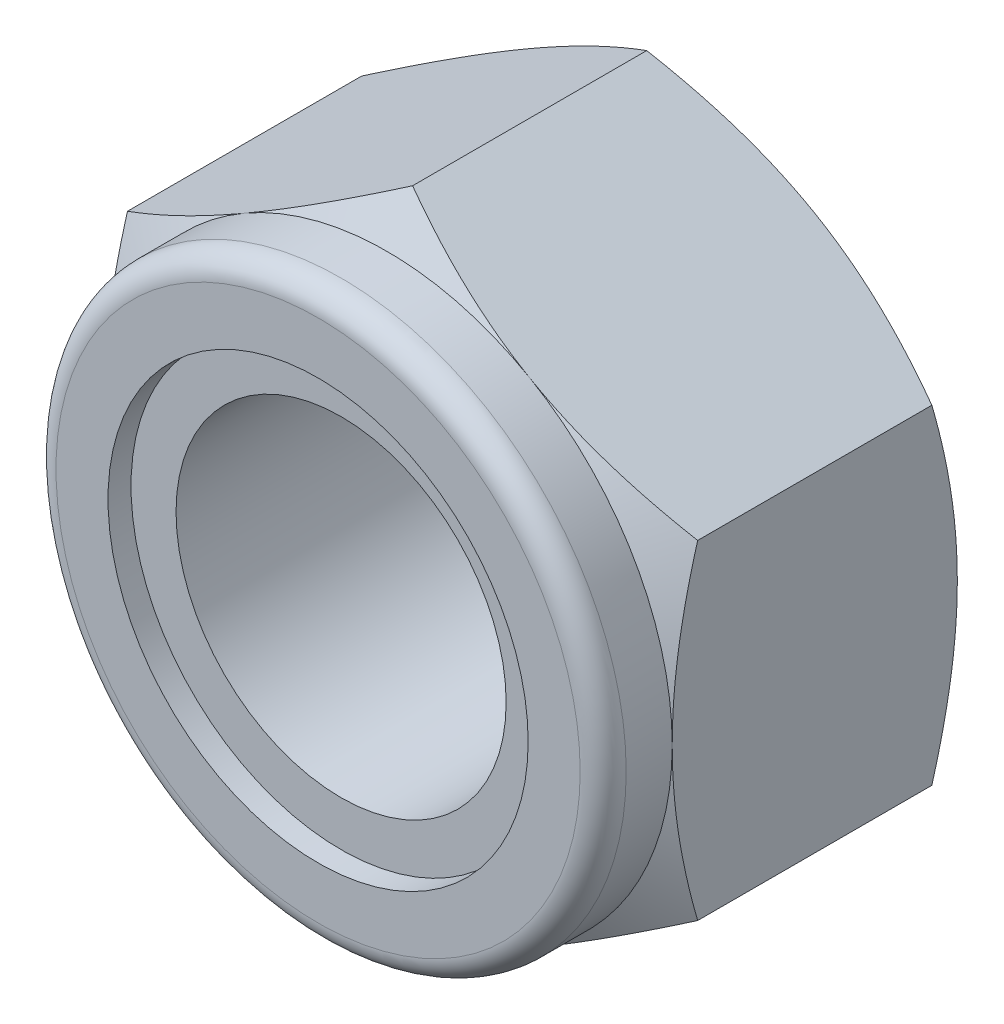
ISO-10303-21;
HEADER;
FILE_DESCRIPTION(('STEP AP214'),'2;1');
FILE_NAME('part.step','',(''),(''),'','','');
FILE_SCHEMA(('AUTOMOTIVE_DESIGN { 1 0 10303 214 1 1 1 1 }'));
ENDSEC;
DATA;
#1=APPLICATION_CONTEXT('core data for automotive mechanical design processes');
#2=APPLICATION_PROTOCOL_DEFINITION('international standard','automotive_design',2000,#1);
#3=PRODUCT_CONTEXT('',#1,'mechanical');
#4=PRODUCT('Part','Part','',(#3));
#5=PRODUCT_RELATED_PRODUCT_CATEGORY('part','',(#4));
#6=PRODUCT_DEFINITION_FORMATION('','',#4);
#7=PRODUCT_DEFINITION_CONTEXT('part definition',#1,'design');
#8=PRODUCT_DEFINITION('design','',#6,#7);
#9=PRODUCT_DEFINITION_SHAPE('','',#8);
#10=(LENGTH_UNIT() NAMED_UNIT(*) SI_UNIT(.MILLI.,.METRE.));
#11=(NAMED_UNIT(*) PLANE_ANGLE_UNIT() SI_UNIT($,.RADIAN.));
#12=(NAMED_UNIT(*) SI_UNIT($,.STERADIAN.) SOLID_ANGLE_UNIT());
#13=UNCERTAINTY_MEASURE_WITH_UNIT(LENGTH_MEASURE(1.E-05),#10,'distance_accuracy_value','');
#14=(GEOMETRIC_REPRESENTATION_CONTEXT(3) GLOBAL_UNCERTAINTY_ASSIGNED_CONTEXT((#13)) GLOBAL_UNIT_ASSIGNED_CONTEXT((#10,
#11,#12)) REPRESENTATION_CONTEXT('',''));
#15=CARTESIAN_POINT('',(0.,0.,0.));
#16=DIRECTION('',(0.,0.,1.));
#17=DIRECTION('',(1.,0.,0.));
#18=AXIS2_PLACEMENT_3D('',#15,#16,#17);
#19=CARTESIAN_POINT('',(0.,0.,-9.5));
#20=DIRECTION('',(0.,0.,1.));
#21=DIRECTION('',(1.,0.,0.));
#22=AXIS2_PLACEMENT_3D('',#19,#20,#21);
#23=CYLINDRICAL_SURFACE('',#22,5.5);
#24=CARTESIAN_POINT('',(0.,0.,1.533333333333));
#25=DIRECTION('',(0.,0.,1.));
#26=DIRECTION('',(1.,0.,0.));
#27=AXIS2_PLACEMENT_3D('',#24,#25,#26);
#28=CIRCLE('',#27,5.5);
#29=CARTESIAN_POINT('',(5.5,0.,1.533333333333));
#30=VERTEX_POINT('',#29);
#31=EDGE_CURVE('E313',#30,#30,#28,.T.);
#32=ORIENTED_EDGE('',*,*,#31,.T.);
#33=EDGE_LOOP('',(#32));
#34=FACE_BOUND('',#33,.T.);
#35=CARTESIAN_POINT('',(0.,0.,-9.12449623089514));
#36=DIRECTION('',(0.,0.,-1.));
#37=DIRECTION('',(-1.,0.,0.));
#38=AXIS2_PLACEMENT_3D('',#35,#36,#37);
#39=CIRCLE('',#38,5.5);
#40=CARTESIAN_POINT('',(-5.5,0.,-9.12449623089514));
#41=VERTEX_POINT('',#40);
#42=EDGE_CURVE('E50',#41,#41,#39,.F.);
#43=ORIENTED_EDGE('',*,*,#42,.F.);
#44=EDGE_LOOP('',(#43));
#45=FACE_BOUND('',#44,.T.);
#46=ADVANCED_FACE('F45',(#34,#45),#23,.F.);
#47=CARTESIAN_POINT('',(0.,10.9696551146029,-9.5));
#48=DIRECTION('',(-0.500000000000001,0.866025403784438,0.));
#49=DIRECTION('',(-0.866025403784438,-0.500000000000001,0.));
#50=AXIS2_PLACEMENT_3D('',#47,#48,#49);
#51=PLANE('',#50);
#52=DIRECTION('',(0.,0.,1.));
#53=VECTOR('',#52,1.);
#54=CARTESIAN_POINT('',(-9.5,5.48482755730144,-9.5));
#55=LINE('',#54,#53);
#56=CARTESIAN_POINT('',(-9.5,5.48482755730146,-8.6514942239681));
#57=VERTEX_POINT('',#56);
#58=CARTESIAN_POINT('',(-9.5,5.48482755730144,-0.848505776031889));
#59=VERTEX_POINT('',#58);
#60=EDGE_CURVE('E277',#57,#59,#55,.T.);
#61=ORIENTED_EDGE('',*,*,#60,.T.);
#62=CARTESIAN_POINT('',(-9.5002,5.4847120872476,-0.848572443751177));
#63=CARTESIAN_POINT('',(-9.2913692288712,5.60528058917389,-0.778973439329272));
#64=CARTESIAN_POINT('',(-9.08175982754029,5.72629863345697,-0.712533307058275));
#65=CARTESIAN_POINT('',(-8.66086011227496,5.96930519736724,-0.586847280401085));
#66=CARTESIAN_POINT('',(-8.44956926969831,6.09129402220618,-0.52760375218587));
#67=CARTESIAN_POINT('',(-7.81229220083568,6.45922610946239,-0.361814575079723));
#68=CARTESIAN_POINT('',(-7.38379023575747,6.70662183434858,-0.26751444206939));
#69=CARTESIAN_POINT('',(-6.74255666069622,7.07683821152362,-0.156938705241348));
#70=CARTESIAN_POINT('',(-6.53174078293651,7.19855281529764,-0.125439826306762));
#71=CARTESIAN_POINT('',(-6.10913296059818,7.44254555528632,-0.0726182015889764));
#72=CARTESIAN_POINT('',(-5.89734099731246,7.56482370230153,-0.0512956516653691));
#73=CARTESIAN_POINT('',(-5.4734037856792,7.80958396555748,-0.0193730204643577));
#74=CARTESIAN_POINT('',(-5.26125925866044,7.93206566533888,-0.0087601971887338));
#75=CARTESIAN_POINT('',(-4.83677424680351,8.17714220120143,0.00151746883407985));
#76=CARTESIAN_POINT('',(-4.62443376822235,8.29973703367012,0.00118264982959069));
#77=CARTESIAN_POINT('',(-4.22745800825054,8.5289310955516,-0.0096733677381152));
#78=CARTESIAN_POINT('',(-4.04279470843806,8.63554650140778,-0.0188702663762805));
#79=CARTESIAN_POINT('',(-3.67389999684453,8.84852796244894,-0.0453653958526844));
#80=CARTESIAN_POINT('',(-3.48966861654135,8.95489399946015,-0.0626641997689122));
#81=CARTESIAN_POINT('',(-2.93768832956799,9.27357996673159,-0.12630448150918));
#82=CARTESIAN_POINT('',(-2.57091646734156,9.4853358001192,-0.184381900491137));
#83=CARTESIAN_POINT('',(-1.83348217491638,9.91109368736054,-0.329576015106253));
#84=CARTESIAN_POINT('',(-1.46291385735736,10.1250414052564,-0.417308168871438));
#85=CARTESIAN_POINT('',(-0.727303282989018,10.5497463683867,-0.616423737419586));
#86=CARTESIAN_POINT('',(-0.362251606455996,10.7605090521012,-0.727760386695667));
#87=CARTESIAN_POINT('',(0.000200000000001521,10.9697705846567,-0.848572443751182));
#88=B_SPLINE_CURVE_WITH_KNOTS('',3,(#62,#63,#64,#65,#66,#67,#68,#69,#70,#71,#72,#73,#74,#75,#76,
#77,#78,#79,#80,#81,#82,#83,#84,#85,#86,#87),.UNSPECIFIED.,.F.,.F.,(4,2,2,2,2,2,2,2,2,2,2,2,4),
(0.,0.752880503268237,1.50600787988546,3.01546870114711,3.75167336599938,4.48789219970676,
5.22323407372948,5.95855322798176,6.59868084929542,7.23885375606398,8.52010929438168,
9.82978009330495,11.1368800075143),.UNSPECIFIED.);
#89=CARTESIAN_POINT('',(-4.75000000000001,8.22724133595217,0.));
#90=VERTEX_POINT('',#89);
#91=EDGE_CURVE('E71',#59,#90,#88,.T.);
#92=ORIENTED_EDGE('',*,*,#91,.T.);
#93=CARTESIAN_POINT('',(0.,10.9696551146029,-0.848505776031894));
#94=VERTEX_POINT('',#93);
#95=EDGE_CURVE('E219',#90,#94,#88,.T.);
#96=ORIENTED_EDGE('',*,*,#95,.T.);
#97=DIRECTION('',(0.,0.,1.));
#98=VECTOR('',#97,1.);
#99=CARTESIAN_POINT('',(0.,10.9696551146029,-9.5));
#100=LINE('',#99,#98);
#101=CARTESIAN_POINT('',(0.,10.9696551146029,-8.6514942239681));
#102=VERTEX_POINT('',#101);
#103=EDGE_CURVE('E258',#102,#94,#100,.T.);
#104=ORIENTED_EDGE('',*,*,#103,.F.);
#105=CARTESIAN_POINT('',(-9.5002,5.4847120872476,-8.65142755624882));
#106=CARTESIAN_POINT('',(-9.2913692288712,5.60528058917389,-8.72102656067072));
#107=CARTESIAN_POINT('',(-9.08175982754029,5.72629863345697,-8.78746669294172));
#108=CARTESIAN_POINT('',(-8.66086011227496,5.96930519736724,-8.91315271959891));
#109=CARTESIAN_POINT('',(-8.44956926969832,6.09129402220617,-8.97239624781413));
#110=CARTESIAN_POINT('',(-7.81229220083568,6.45922610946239,-9.13818542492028));
#111=CARTESIAN_POINT('',(-7.38379023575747,6.70662183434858,-9.23248555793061));
#112=CARTESIAN_POINT('',(-6.74255666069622,7.07683821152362,-9.34306129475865));
#113=CARTESIAN_POINT('',(-6.53174078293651,7.19855281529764,-9.37456017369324));
#114=CARTESIAN_POINT('',(-6.10913296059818,7.44254555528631,-9.42738179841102));
#115=CARTESIAN_POINT('',(-5.89734099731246,7.56482370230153,-9.44870434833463));
#116=CARTESIAN_POINT('',(-5.4734037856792,7.80958396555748,-9.48062697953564));
#117=CARTESIAN_POINT('',(-5.26125925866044,7.93206566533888,-9.49123980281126));
#118=CARTESIAN_POINT('',(-4.83677424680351,8.17714220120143,-9.50151746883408));
#119=CARTESIAN_POINT('',(-4.62443376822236,8.29973703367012,-9.50118264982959));
#120=CARTESIAN_POINT('',(-4.22745800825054,8.5289310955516,-9.49032663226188));
#121=CARTESIAN_POINT('',(-4.04279470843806,8.63554650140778,-9.48112973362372));
#122=CARTESIAN_POINT('',(-3.67389999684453,8.84852796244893,-9.45463460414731));
#123=CARTESIAN_POINT('',(-3.48966861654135,8.95489399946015,-9.43733580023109));
#124=CARTESIAN_POINT('',(-2.93768832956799,9.27357996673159,-9.37369551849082));
#125=CARTESIAN_POINT('',(-2.57091646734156,9.4853358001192,-9.31561809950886));
#126=CARTESIAN_POINT('',(-1.83348217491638,9.91109368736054,-9.17042398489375));
#127=CARTESIAN_POINT('',(-1.46291385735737,10.1250414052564,-9.08269183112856));
#128=CARTESIAN_POINT('',(-0.727303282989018,10.5497463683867,-8.88357626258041));
#129=CARTESIAN_POINT('',(-0.362251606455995,10.7605090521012,-8.77223961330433));
#130=CARTESIAN_POINT('',(0.000200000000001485,10.9697705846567,-8.65142755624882));
#131=B_SPLINE_CURVE_WITH_KNOTS('',3,(#105,#106,#107,#108,#109,#110,#111,#112,#113,#114,#115,
#116,#117,#118,#119,#120,#121,#122,#123,#124,#125,#126,#127,#128,#129,#130),.UNSPECIFIED.,.F.,
.F.,(4,2,2,2,2,2,2,2,2,2,2,2,4),(0.,0.752880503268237,1.50600787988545,3.01546870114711,
3.75167336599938,4.48789219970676,5.22323407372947,5.95855322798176,6.59868084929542,
7.23885375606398,8.52010929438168,9.82978009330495,11.1368800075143),.UNSPECIFIED.);
#132=CARTESIAN_POINT('',(-4.75000000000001,8.22724133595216,-9.5));
#133=VERTEX_POINT('',#132);
#134=EDGE_CURVE('E280',#133,#102,#131,.T.);
#135=ORIENTED_EDGE('',*,*,#134,.F.);
#136=EDGE_CURVE('E252',#57,#133,#131,.T.);
#137=ORIENTED_EDGE('',*,*,#136,.F.);
#138=EDGE_LOOP('',(#61,#92,#96,#104,#135,#137));
#139=FACE_BOUND('',#138,.T.);
#140=ADVANCED_FACE('F47',(#139),#51,.T.);
#141=CARTESIAN_POINT('',(9.5,5.48482755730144,-9.5));
#142=DIRECTION('',(0.500000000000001,0.866025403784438,0.));
#143=DIRECTION('',(-0.866025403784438,0.500000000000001,0.));
#144=AXIS2_PLACEMENT_3D('',#141,#142,#143);
#145=PLANE('',#144);
#146=ORIENTED_EDGE('',*,*,#103,.T.);
#147=CARTESIAN_POINT('',(-0.000199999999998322,10.9697705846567,-0.848572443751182));
#148=CARTESIAN_POINT('',(0.208630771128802,10.8492020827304,-0.778973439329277));
#149=CARTESIAN_POINT('',(0.418240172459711,10.7281840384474,-0.71253330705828));
#150=CARTESIAN_POINT('',(0.839139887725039,10.4851774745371,-0.586847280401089));
#151=CARTESIAN_POINT('',(1.05043073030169,10.3631886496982,-0.527603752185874));
#152=CARTESIAN_POINT('',(1.68770779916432,9.99525656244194,-0.361814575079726));
#153=CARTESIAN_POINT('',(2.11620976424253,9.74786083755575,-0.267514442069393));
#154=CARTESIAN_POINT('',(2.75744333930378,9.37764446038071,-0.15693870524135));
#155=CARTESIAN_POINT('',(2.96825921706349,9.25592985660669,-0.125439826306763));
#156=CARTESIAN_POINT('',(3.39086703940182,9.01193711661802,-0.0726182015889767));
#157=CARTESIAN_POINT('',(3.60265900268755,8.88965896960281,-0.0512956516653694));
#158=CARTESIAN_POINT('',(4.0265962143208,8.64489870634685,-0.0193730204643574));
#159=CARTESIAN_POINT('',(4.23874074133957,8.52241700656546,-0.00876019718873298));
#160=CARTESIAN_POINT('',(4.66322575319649,8.2773404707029,0.00151746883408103));
#161=CARTESIAN_POINT('',(4.87556623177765,8.15474563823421,0.00118264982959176));
#162=CARTESIAN_POINT('',(5.27254199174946,7.92555157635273,-0.00967336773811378));
#163=CARTESIAN_POINT('',(5.45720529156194,7.81893617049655,-0.0188702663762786));
#164=CARTESIAN_POINT('',(5.82610000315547,7.6059547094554,-0.0453653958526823));
#165=CARTESIAN_POINT('',(6.01033138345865,7.49958867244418,-0.0626641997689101));
#166=CARTESIAN_POINT('',(6.56231167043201,7.18090270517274,-0.126304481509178));
#167=CARTESIAN_POINT('',(6.92908353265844,6.96914687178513,-0.184381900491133));
#168=CARTESIAN_POINT('',(7.66651782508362,6.54338898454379,-0.329576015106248));
#169=CARTESIAN_POINT('',(8.03708614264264,6.32944126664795,-0.417308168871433));
#170=CARTESIAN_POINT('',(8.77269671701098,5.90473630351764,-0.616423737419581));
#171=CARTESIAN_POINT('',(9.13774839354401,5.69397361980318,-0.727760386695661));
#172=CARTESIAN_POINT('',(9.5002,5.4847120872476,-0.848572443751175));
#173=B_SPLINE_CURVE_WITH_KNOTS('',3,(#147,#148,#149,#150,#151,#152,#153,#154,#155,#156,#157,
#158,#159,#160,#161,#162,#163,#164,#165,#166,#167,#168,#169,#170,#171,#172),.UNSPECIFIED.,.F.,
.F.,(4,2,2,2,2,2,2,2,2,2,2,2,4),(0.,0.752880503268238,1.50600787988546,3.01546870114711,
3.75167336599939,4.48789219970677,5.22323407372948,5.95855322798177,6.59868084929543,
7.23885375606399,8.52010929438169,9.82978009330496,11.1368800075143),.UNSPECIFIED.);
#174=CARTESIAN_POINT('',(4.75000000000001,8.22724133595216,0.));
#175=VERTEX_POINT('',#174);
#176=EDGE_CURVE('E229',#94,#175,#173,.T.);
#177=ORIENTED_EDGE('',*,*,#176,.T.);
#178=CARTESIAN_POINT('',(9.5,5.48482755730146,-0.848505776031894));
#179=VERTEX_POINT('',#178);
#180=EDGE_CURVE('E220',#175,#179,#173,.T.);
#181=ORIENTED_EDGE('',*,*,#180,.T.);
#182=DIRECTION('',(0.,0.,1.));
#183=VECTOR('',#182,1.);
#184=CARTESIAN_POINT('',(9.5,5.48482755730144,-9.5));
#185=LINE('',#184,#183);
#186=CARTESIAN_POINT('',(9.5,5.48482755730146,-8.6514942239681));
#187=VERTEX_POINT('',#186);
#188=EDGE_CURVE('E263',#187,#179,#185,.T.);
#189=ORIENTED_EDGE('',*,*,#188,.F.);
#190=CARTESIAN_POINT('',(-0.000199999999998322,10.9697705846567,-8.65142755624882));
#191=CARTESIAN_POINT('',(0.208630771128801,10.8492020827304,-8.72102656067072));
#192=CARTESIAN_POINT('',(0.418240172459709,10.7281840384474,-8.78746669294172));
#193=CARTESIAN_POINT('',(0.839139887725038,10.4851774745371,-8.91315271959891));
#194=CARTESIAN_POINT('',(1.05043073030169,10.3631886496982,-8.97239624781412));
#195=CARTESIAN_POINT('',(1.68770779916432,9.99525656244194,-9.13818542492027));
#196=CARTESIAN_POINT('',(2.11620976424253,9.74786083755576,-9.23248555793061));
#197=CARTESIAN_POINT('',(2.75744333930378,9.37764446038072,-9.34306129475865));
#198=CARTESIAN_POINT('',(2.96825921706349,9.2559298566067,-9.37456017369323));
#199=CARTESIAN_POINT('',(3.39086703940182,9.01193711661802,-9.42738179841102));
#200=CARTESIAN_POINT('',(3.60265900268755,8.88965896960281,-9.44870434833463));
#201=CARTESIAN_POINT('',(4.0265962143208,8.64489870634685,-9.48062697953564));
#202=CARTESIAN_POINT('',(4.23874074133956,8.52241700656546,-9.49123980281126));
#203=CARTESIAN_POINT('',(4.66322575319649,8.2773404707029,-9.50151746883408));
#204=CARTESIAN_POINT('',(4.87556623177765,8.15474563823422,-9.50118264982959));
#205=CARTESIAN_POINT('',(5.27254199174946,7.92555157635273,-9.49032663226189));
#206=CARTESIAN_POINT('',(5.45720529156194,7.81893617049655,-9.48112973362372));
#207=CARTESIAN_POINT('',(5.82610000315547,7.6059547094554,-9.45463460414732));
#208=CARTESIAN_POINT('',(6.01033138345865,7.49958867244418,-9.43733580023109));
#209=CARTESIAN_POINT('',(6.56231167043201,7.18090270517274,-9.37369551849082));
#210=CARTESIAN_POINT('',(6.92908353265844,6.96914687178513,-9.31561809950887));
#211=CARTESIAN_POINT('',(7.66651782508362,6.54338898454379,-9.17042398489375));
#212=CARTESIAN_POINT('',(8.03708614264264,6.32944126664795,-9.08269183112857));
#213=CARTESIAN_POINT('',(8.77269671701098,5.90473630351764,-8.88357626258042));
#214=CARTESIAN_POINT('',(9.13774839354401,5.69397361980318,-8.77223961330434));
#215=CARTESIAN_POINT('',(9.5002,5.4847120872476,-8.65142755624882));
#216=B_SPLINE_CURVE_WITH_KNOTS('',3,(#190,#191,#192,#193,#194,#195,#196,#197,#198,#199,#200,
#201,#202,#203,#204,#205,#206,#207,#208,#209,#210,#211,#212,#213,#214,#215),.UNSPECIFIED.,.F.,
.F.,(4,2,2,2,2,2,2,2,2,2,2,2,4),(0.,0.752880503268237,1.50600787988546,3.01546870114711,
3.75167336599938,4.48789219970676,5.22323407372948,5.95855322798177,6.59868084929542,
7.23885375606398,8.52010929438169,9.82978009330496,11.1368800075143),.UNSPECIFIED.);
#217=CARTESIAN_POINT('',(4.75000000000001,8.22724133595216,-9.5));
#218=VERTEX_POINT('',#217);
#219=EDGE_CURVE('E242',#218,#187,#216,.T.);
#220=ORIENTED_EDGE('',*,*,#219,.F.);
#221=EDGE_CURVE('E250',#102,#218,#216,.T.);
#222=ORIENTED_EDGE('',*,*,#221,.F.);
#223=EDGE_LOOP('',(#146,#177,#181,#189,#220,#222));
#224=FACE_BOUND('',#223,.T.);
#225=ADVANCED_FACE('F232',(#224),#145,.T.);
#226=CARTESIAN_POINT('',(9.5,5.48482755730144,-9.5));
#227=DIRECTION('',(-1.,0.,0.));
#228=DIRECTION('',(0.,0.,1.));
#229=AXIS2_PLACEMENT_3D('',#226,#227,#228);
#230=PLANE('',#229);
#231=CARTESIAN_POINT('',(9.5,-14.5465709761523,-4.54600370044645));
#232=CARTESIAN_POINT('',(9.5,-14.3380268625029,-4.44519656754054));
#233=CARTESIAN_POINT('',(9.5,-14.129230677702,-4.34491115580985));
#234=CARTESIAN_POINT('',(9.5,-13.7110809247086,-4.14550353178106));
#235=CARTESIAN_POINT('',(9.5,-13.5017273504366,-4.04638133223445));
#236=CARTESIAN_POINT('',(9.5,-12.8726893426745,-3.75091045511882));
#237=CARTESIAN_POINT('',(9.5,-12.4520954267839,-3.55649036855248));
#238=CARTESIAN_POINT('',(9.5,-11.6055942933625,-3.17293577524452));
#239=CARTESIAN_POINT('',(9.5,-11.1796704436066,-2.98383788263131));
#240=CARTESIAN_POINT('',(9.5,-10.3243227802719,-2.61376109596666));
#241=CARTESIAN_POINT('',(9.5,-9.89489915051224,-2.43278177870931));
#242=CARTESIAN_POINT('',(9.5,-9.02653674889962,-2.07895754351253));
#243=CARTESIAN_POINT('',(9.5,-8.58754588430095,-1.90623976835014));
#244=CARTESIAN_POINT('',(9.5,-7.70438743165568,-1.57433108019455));
#245=CARTESIAN_POINT('',(9.5,-7.26021927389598,-1.41514167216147));
#246=CARTESIAN_POINT('',(9.5,-6.36690631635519,-1.11456802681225));
#247=CARTESIAN_POINT('',(9.5,-5.9177743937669,-0.97314593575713));
#248=CARTESIAN_POINT('',(9.5,-5.01314169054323,-0.712697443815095));
#249=CARTESIAN_POINT('',(9.5,-4.55764297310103,-0.593663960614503));
#250=CARTESIAN_POINT('',(9.5,-3.63988944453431,-0.383780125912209));
#251=CARTESIAN_POINT('',(9.5,-3.17763286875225,-0.292937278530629));
#252=CARTESIAN_POINT('',(9.5,-2.48018032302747,-0.182364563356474));
#253=CARTESIAN_POINT('',(9.5,-2.24698958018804,-0.149786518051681));
#254=CARTESIAN_POINT('',(9.5,-1.77951479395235,-0.0938352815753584));
#255=CARTESIAN_POINT('',(9.5,-1.54523086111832,-0.070461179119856));
#256=CARTESIAN_POINT('',(9.5,-1.07737258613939,-0.0335468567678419));
#257=CARTESIAN_POINT('',(9.5,-0.843803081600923,-0.0199455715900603));
#258=CARTESIAN_POINT('',(9.5,-0.376297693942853,-0.00264879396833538));
#259=CARTESIAN_POINT('',(9.5,-0.142361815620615,0.00104682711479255));
#260=CARTESIAN_POINT('',(9.5,0.325389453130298,-0.00155578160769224));
#261=CARTESIAN_POINT('',(9.5,0.55920485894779,-0.00785120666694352));
#262=CARTESIAN_POINT('',(9.5,1.02636653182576,-0.0302793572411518));
#263=CARTESIAN_POINT('',(9.5,1.25971277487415,-0.0464125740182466));
#264=CARTESIAN_POINT('',(9.5,1.82527222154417,-0.0971001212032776));
#265=CARTESIAN_POINT('',(9.5,2.15705089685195,-0.136583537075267));
#266=CARTESIAN_POINT('',(9.5,2.81806585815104,-0.233246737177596));
#267=CARTESIAN_POINT('',(9.5,3.14730142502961,-0.290431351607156));
#268=CARTESIAN_POINT('',(9.5,3.80295855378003,-0.420468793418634));
#269=CARTESIAN_POINT('',(9.5,4.12937714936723,-0.493336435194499));
#270=CARTESIAN_POINT('',(9.5,4.77885595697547,-0.652516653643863));
#271=CARTESIAN_POINT('',(9.5,5.10191648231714,-0.738827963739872));
#272=CARTESIAN_POINT('',(9.5,5.75263605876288,-0.925086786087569));
#273=CARTESIAN_POINT('',(9.5,6.08021372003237,-1.02531669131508));
#274=CARTESIAN_POINT('',(9.5,6.73190653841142,-1.23567979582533));
#275=CARTESIAN_POINT('',(9.5,7.0560239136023,-1.34580616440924));
#276=CARTESIAN_POINT('',(9.5,7.6994955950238,-1.57368742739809));
#277=CARTESIAN_POINT('',(9.5,8.01886644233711,-1.69139589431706));
#278=CARTESIAN_POINT('',(9.5,8.6551302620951,-1.93372164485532));
#279=CARTESIAN_POINT('',(9.5,8.97202217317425,-2.05834172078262));
#280=CARTESIAN_POINT('',(9.5,9.28776285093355,-2.18573389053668));
#281=B_SPLINE_CURVE_WITH_KNOTS('',3,(#231,#232,#233,#234,#235,#236,#237,#238,#239,#240,#241,
#242,#243,#244,#245,#246,#247,#248,#249,#250,#251,#252,#253,#254,#255,#256,#257,#258,#259,#260,
#261,#262,#263,#264,#265,#266,#267,#268,#269,#270,#271,#272,#273,#274,#275,#276,#277,#278,#279,
#280),.UNSPECIFIED.,.F.,.F.,(4,2,2,2,2,2,2,2,2,2,2,2,2,2,2,2,2,2,2,2,2,2,2,2,4),(0.,
0.694890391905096,1.38978839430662,2.7798104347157,4.17778700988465,5.57569062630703,
6.99075616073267,8.40597890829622,9.81813342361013,11.2298404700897,12.6419229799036,
13.3481360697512,14.0542792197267,14.7559707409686,15.4576531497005,16.1591386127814,
16.8606591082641,17.8624602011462,18.8645349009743,19.8675603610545,20.8704913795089,
21.8980064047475,22.9248175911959,23.9458491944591,24.9672963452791),.UNSPECIFIED.);
#282=CARTESIAN_POINT('',(9.5,-5.48482755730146,-0.848505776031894));
#283=VERTEX_POINT('',#282);
#284=CARTESIAN_POINT('',(9.5,0.,0.));
#285=VERTEX_POINT('',#284);
#286=EDGE_CURVE('E206',#283,#285,#281,.T.);
#287=ORIENTED_EDGE('',*,*,#286,.F.);
#288=DIRECTION('',(0.,0.,1.));
#289=VECTOR('',#288,1.);
#290=CARTESIAN_POINT('',(9.5,-5.48482755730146,-9.5));
#291=LINE('',#290,#289);
#292=CARTESIAN_POINT('',(9.5,-5.48482755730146,-8.6514942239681));
#293=VERTEX_POINT('',#292);
#294=EDGE_CURVE('E267',#293,#283,#291,.T.);
#295=ORIENTED_EDGE('',*,*,#294,.F.);
#296=CARTESIAN_POINT('',(9.5,-14.5465709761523,-4.95399629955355));
#297=CARTESIAN_POINT('',(9.5,-14.3380268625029,-5.05480343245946));
#298=CARTESIAN_POINT('',(9.5,-14.129230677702,-5.15508884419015));
#299=CARTESIAN_POINT('',(9.5,-13.7110809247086,-5.35449646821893));
#300=CARTESIAN_POINT('',(9.5,-13.5017273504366,-5.45361866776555));
#301=CARTESIAN_POINT('',(9.5,-12.8726893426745,-5.74908954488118));
#302=CARTESIAN_POINT('',(9.5,-12.4520954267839,-5.94350963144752));
#303=CARTESIAN_POINT('',(9.5,-11.6055942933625,-6.32706422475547));
#304=CARTESIAN_POINT('',(9.5,-11.1796704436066,-6.51616211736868));
#305=CARTESIAN_POINT('',(9.5,-10.3243227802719,-6.88623890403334));
#306=CARTESIAN_POINT('',(9.5,-9.89489915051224,-7.06721822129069));
#307=CARTESIAN_POINT('',(9.5,-9.02653674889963,-7.42104245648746));
#308=CARTESIAN_POINT('',(9.5,-8.58754588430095,-7.59376023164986));
#309=CARTESIAN_POINT('',(9.5,-7.70438743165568,-7.92566891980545));
#310=CARTESIAN_POINT('',(9.5,-7.26021927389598,-8.08485832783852));
#311=CARTESIAN_POINT('',(9.5,-6.36690631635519,-8.38543197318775));
#312=CARTESIAN_POINT('',(9.5,-5.91777439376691,-8.52685406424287));
#313=CARTESIAN_POINT('',(9.5,-5.01314169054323,-8.7873025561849));
#314=CARTESIAN_POINT('',(9.5,-4.55764297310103,-8.9063360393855));
#315=CARTESIAN_POINT('',(9.5,-3.63988944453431,-9.11621987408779));
#316=CARTESIAN_POINT('',(9.5,-3.17763286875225,-9.20706272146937));
#317=CARTESIAN_POINT('',(9.5,-2.48018032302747,-9.31763543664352));
#318=CARTESIAN_POINT('',(9.5,-2.24698958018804,-9.35021348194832));
#319=CARTESIAN_POINT('',(9.5,-1.77951479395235,-9.40616471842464));
#320=CARTESIAN_POINT('',(9.5,-1.54523086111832,-9.42953882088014));
#321=CARTESIAN_POINT('',(9.5,-1.07737258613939,-9.46645314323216));
#322=CARTESIAN_POINT('',(9.5,-0.843803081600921,-9.48005442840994));
#323=CARTESIAN_POINT('',(9.5,-0.376297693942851,-9.49735120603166));
#324=CARTESIAN_POINT('',(9.5,-0.142361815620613,-9.50104682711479));
#325=CARTESIAN_POINT('',(9.5,0.3253894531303,-9.49844421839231));
#326=CARTESIAN_POINT('',(9.5,0.559204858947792,-9.49214879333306));
#327=CARTESIAN_POINT('',(9.5,1.02636653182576,-9.46972064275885));
#328=CARTESIAN_POINT('',(9.5,1.25971277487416,-9.45358742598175));
#329=CARTESIAN_POINT('',(9.5,1.82527222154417,-9.40289987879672));
#330=CARTESIAN_POINT('',(9.5,2.15705089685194,-9.36341646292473));
#331=CARTESIAN_POINT('',(9.5,2.81806585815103,-9.2667532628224));
#332=CARTESIAN_POINT('',(9.5,3.1473014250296,-9.20956864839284));
#333=CARTESIAN_POINT('',(9.5,3.80295855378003,-9.07953120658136));
#334=CARTESIAN_POINT('',(9.5,4.12937714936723,-9.0066635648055));
#335=CARTESIAN_POINT('',(9.5,4.77885595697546,-8.84748334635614));
#336=CARTESIAN_POINT('',(9.5,5.10191648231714,-8.76117203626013));
#337=CARTESIAN_POINT('',(9.5,5.75263605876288,-8.57491321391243));
#338=CARTESIAN_POINT('',(9.5,6.08021372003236,-8.47468330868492));
#339=CARTESIAN_POINT('',(9.5,6.73190653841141,-8.26432020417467));
#340=CARTESIAN_POINT('',(9.5,7.0560239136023,-8.15419383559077));
#341=CARTESIAN_POINT('',(9.5,7.69949559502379,-7.9263125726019));
#342=CARTESIAN_POINT('',(9.5,8.0188664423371,-7.80860410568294));
#343=CARTESIAN_POINT('',(9.5,8.6551302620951,-7.56627835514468));
#344=CARTESIAN_POINT('',(9.5,8.97202217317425,-7.44165827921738));
#345=CARTESIAN_POINT('',(9.5,9.28776285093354,-7.31426610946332));
#346=B_SPLINE_CURVE_WITH_KNOTS('',3,(#296,#297,#298,#299,#300,#301,#302,#303,#304,#305,#306,
#307,#308,#309,#310,#311,#312,#313,#314,#315,#316,#317,#318,#319,#320,#321,#322,#323,#324,#325,
#326,#327,#328,#329,#330,#331,#332,#333,#334,#335,#336,#337,#338,#339,#340,#341,#342,#343,#344,
#345),.UNSPECIFIED.,.F.,.F.,(4,2,2,2,2,2,2,2,2,2,2,2,2,2,2,2,2,2,2,2,2,2,2,2,4),(0.,
0.694890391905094,1.38978839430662,2.77981043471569,4.17778700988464,5.57569062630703,
6.99075616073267,8.40597890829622,9.81813342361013,11.2298404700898,12.6419229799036,
13.3481360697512,14.0542792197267,14.7559707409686,15.4576531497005,16.1591386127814,
16.8606591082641,17.8624602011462,18.8645349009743,19.8675603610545,20.8704913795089,
21.8980064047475,22.9248175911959,23.9458491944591,24.9672963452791),.UNSPECIFIED.);
#347=CARTESIAN_POINT('',(9.5,0.,-9.5));
#348=VERTEX_POINT('',#347);
#349=EDGE_CURVE('E409',#293,#348,#346,.T.);
#350=ORIENTED_EDGE('',*,*,#349,.T.);
#351=EDGE_CURVE('E251',#348,#187,#346,.T.);
#352=ORIENTED_EDGE('',*,*,#351,.T.);
#353=ORIENTED_EDGE('',*,*,#188,.T.);
#354=EDGE_CURVE('E218',#285,#179,#281,.T.);
#355=ORIENTED_EDGE('',*,*,#354,.F.);
#356=EDGE_LOOP('',(#287,#295,#350,#352,#353,#355));
#357=FACE_BOUND('',#356,.T.);
#358=ADVANCED_FACE('F236',(#357),#230,.F.);
#359=CARTESIAN_POINT('',(0.,-10.9696551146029,-9.5));
#360=DIRECTION('',(0.5,-0.866025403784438,0.));
#361=DIRECTION('',(0.866025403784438,0.5,0.));
#362=AXIS2_PLACEMENT_3D('',#359,#360,#361);
#363=PLANE('',#362);
#364=ORIENTED_EDGE('',*,*,#294,.T.);
#365=CARTESIAN_POINT('',(9.5002,-5.48471208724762,-0.848572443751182));
#366=CARTESIAN_POINT('',(9.2913692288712,-5.60528058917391,-0.778973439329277));
#367=CARTESIAN_POINT('',(9.08175982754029,-5.72629863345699,-0.71253330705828));
#368=CARTESIAN_POINT('',(8.66086011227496,-5.96930519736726,-0.58684728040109));
#369=CARTESIAN_POINT('',(8.44956926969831,-6.09129402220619,-0.527603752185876));
#370=CARTESIAN_POINT('',(7.81229220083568,-6.45922610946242,-0.361814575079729));
#371=CARTESIAN_POINT('',(7.38379023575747,-6.7066218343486,-0.267514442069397));
#372=CARTESIAN_POINT('',(6.74255666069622,-7.07683821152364,-0.156938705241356));
#373=CARTESIAN_POINT('',(6.53174078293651,-7.19855281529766,-0.12543982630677));
#374=CARTESIAN_POINT('',(6.10913296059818,-7.44254555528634,-0.0726182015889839));
#375=CARTESIAN_POINT('',(5.89734099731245,-7.56482370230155,-0.0512956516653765));
#376=CARTESIAN_POINT('',(5.4734037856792,-7.80958396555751,-0.0193730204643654));
#377=CARTESIAN_POINT('',(5.26125925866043,-7.9320656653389,-0.00876019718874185));
#378=CARTESIAN_POINT('',(4.83677424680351,-8.17714220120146,0.00151746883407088));
#379=CARTESIAN_POINT('',(4.62443376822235,-8.29973703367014,0.00118264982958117));
#380=CARTESIAN_POINT('',(4.22745800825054,-8.52893109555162,-0.0096733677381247));
#381=CARTESIAN_POINT('',(4.04279470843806,-8.6355465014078,-0.0188702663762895));
#382=CARTESIAN_POINT('',(3.67389999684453,-8.84852796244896,-0.0453653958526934));
#383=CARTESIAN_POINT('',(3.48966861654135,-8.95489399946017,-0.0626641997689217));
#384=CARTESIAN_POINT('',(2.93768832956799,-9.27357996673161,-0.126304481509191));
#385=CARTESIAN_POINT('',(2.57091646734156,-9.48533580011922,-0.184381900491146));
#386=CARTESIAN_POINT('',(1.83348217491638,-9.91109368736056,-0.329576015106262));
#387=CARTESIAN_POINT('',(1.46291385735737,-10.1250414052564,-0.417308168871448));
#388=CARTESIAN_POINT('',(0.727303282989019,-10.5497463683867,-0.616423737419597));
#389=CARTESIAN_POINT('',(0.362251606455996,-10.7605090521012,-0.727760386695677));
#390=CARTESIAN_POINT('',(-0.000200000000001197,-10.9697705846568,-0.848572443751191));
#391=B_SPLINE_CURVE_WITH_KNOTS('',3,(#365,#366,#367,#368,#369,#370,#371,#372,#373,#374,#375,
#376,#377,#378,#379,#380,#381,#382,#383,#384,#385,#386,#387,#388,#389,#390),.UNSPECIFIED.,.F.,
.F.,(4,2,2,2,2,2,2,2,2,2,2,2,4),(0.,0.752880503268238,1.50600787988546,3.01546870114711,
3.75167336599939,4.48789219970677,5.22323407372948,5.95855322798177,6.59868084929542,
7.23885375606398,8.52010929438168,9.82978009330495,11.1368800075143),.UNSPECIFIED.);
#392=CARTESIAN_POINT('',(4.75,-8.22724133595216,0.));
#393=VERTEX_POINT('',#392);
#394=EDGE_CURVE('E403',#283,#393,#391,.T.);
#395=ORIENTED_EDGE('',*,*,#394,.T.);
#396=CARTESIAN_POINT('',(0.,-10.9696551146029,-0.848505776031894));
#397=VERTEX_POINT('',#396);
#398=EDGE_CURVE('E199',#393,#397,#391,.T.);
#399=ORIENTED_EDGE('',*,*,#398,.T.);
#400=DIRECTION('',(0.,0.,1.));
#401=VECTOR('',#400,1.);
#402=CARTESIAN_POINT('',(0.,-10.9696551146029,-9.5));
#403=LINE('',#402,#401);
#404=CARTESIAN_POINT('',(0.,-10.9696551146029,-8.6514942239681));
#405=VERTEX_POINT('',#404);
#406=EDGE_CURVE('E271',#405,#397,#403,.T.);
#407=ORIENTED_EDGE('',*,*,#406,.F.);
#408=CARTESIAN_POINT('',(9.5002,-5.48471208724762,-8.65142755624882));
#409=CARTESIAN_POINT('',(9.2913692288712,-5.60528058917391,-8.72102656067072));
#410=CARTESIAN_POINT('',(9.08175982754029,-5.72629863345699,-8.78746669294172));
#411=CARTESIAN_POINT('',(8.66086011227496,-5.96930519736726,-8.91315271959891));
#412=CARTESIAN_POINT('',(8.44956926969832,-6.09129402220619,-8.97239624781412));
#413=CARTESIAN_POINT('',(7.81229220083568,-6.45922610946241,-9.13818542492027));
#414=CARTESIAN_POINT('',(7.38379023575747,-6.7066218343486,-9.2324855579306));
#415=CARTESIAN_POINT('',(6.74255666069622,-7.07683821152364,-9.34306129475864));
#416=CARTESIAN_POINT('',(6.53174078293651,-7.19855281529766,-9.37456017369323));
#417=CARTESIAN_POINT('',(6.10913296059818,-7.44254555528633,-9.42738179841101));
#418=CARTESIAN_POINT('',(5.89734099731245,-7.56482370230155,-9.44870434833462));
#419=CARTESIAN_POINT('',(5.4734037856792,-7.8095839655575,-9.48062697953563));
#420=CARTESIAN_POINT('',(5.26125925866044,-7.9320656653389,-9.49123980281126));
#421=CARTESIAN_POINT('',(4.83677424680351,-8.17714220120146,-9.50151746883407));
#422=CARTESIAN_POINT('',(4.62443376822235,-8.29973703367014,-9.50118264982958));
#423=CARTESIAN_POINT('',(4.22745800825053,-8.52893109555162,-9.49032663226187));
#424=CARTESIAN_POINT('',(4.04279470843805,-8.63554650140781,-9.48112973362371));
#425=CARTESIAN_POINT('',(3.67389999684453,-8.84852796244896,-9.4546346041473));
#426=CARTESIAN_POINT('',(3.48966861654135,-8.95489399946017,-9.43733580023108));
#427=CARTESIAN_POINT('',(2.93768832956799,-9.27357996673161,-9.37369551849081));
#428=CARTESIAN_POINT('',(2.57091646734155,-9.48533580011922,-9.31561809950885));
#429=CARTESIAN_POINT('',(1.83348217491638,-9.91109368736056,-9.17042398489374));
#430=CARTESIAN_POINT('',(1.46291385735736,-10.1250414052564,-9.08269183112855));
#431=CARTESIAN_POINT('',(0.727303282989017,-10.5497463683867,-8.8835762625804));
#432=CARTESIAN_POINT('',(0.362251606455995,-10.7605090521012,-8.77223961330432));
#433=CARTESIAN_POINT('',(-0.00020000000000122,-10.9697705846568,-8.65142755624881));
#434=B_SPLINE_CURVE_WITH_KNOTS('',3,(#408,#409,#410,#411,#412,#413,#414,#415,#416,#417,#418,
#419,#420,#421,#422,#423,#424,#425,#426,#427,#428,#429,#430,#431,#432,#433),.UNSPECIFIED.,.F.,
.F.,(4,2,2,2,2,2,2,2,2,2,2,2,4),(0.,0.752880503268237,1.50600787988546,3.01546870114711,
3.75167336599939,4.48789219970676,5.22323407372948,5.95855322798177,6.59868084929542,
7.23885375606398,8.52010929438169,9.82978009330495,11.1368800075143),.UNSPECIFIED.);
#435=CARTESIAN_POINT('',(4.75,-8.22724133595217,-9.5));
#436=VERTEX_POINT('',#435);
#437=EDGE_CURVE('E380',#436,#405,#434,.T.);
#438=ORIENTED_EDGE('',*,*,#437,.F.);
#439=EDGE_CURVE('E405',#293,#436,#434,.T.);
#440=ORIENTED_EDGE('',*,*,#439,.F.);
#441=EDGE_LOOP('',(#364,#395,#399,#407,#438,#440));
#442=FACE_BOUND('',#441,.T.);
#443=ADVANCED_FACE('F388',(#442),#363,.T.);
#444=CARTESIAN_POINT('',(-9.5,-5.48482755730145,-9.5));
#445=DIRECTION('',(-0.500000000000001,-0.866025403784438,0.));
#446=DIRECTION('',(0.866025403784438,-0.500000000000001,0.));
#447=AXIS2_PLACEMENT_3D('',#444,#445,#446);
#448=PLANE('',#447);
#449=ORIENTED_EDGE('',*,*,#406,.T.);
#450=CARTESIAN_POINT('',(0.000199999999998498,-10.9697705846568,-0.848572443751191));
#451=CARTESIAN_POINT('',(-0.208630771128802,-10.8492020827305,-0.778973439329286));
#452=CARTESIAN_POINT('',(-0.418240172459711,-10.7281840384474,-0.712533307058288));
#453=CARTESIAN_POINT('',(-0.839139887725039,-10.4851774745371,-0.586847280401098));
#454=CARTESIAN_POINT('',(-1.05043073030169,-10.3631886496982,-0.527603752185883));
#455=CARTESIAN_POINT('',(-1.68770779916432,-9.99525656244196,-0.361814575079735));
#456=CARTESIAN_POINT('',(-2.11620976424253,-9.74786083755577,-0.267514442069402));
#457=CARTESIAN_POINT('',(-2.75744333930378,-9.37764446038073,-0.156938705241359));
#458=CARTESIAN_POINT('',(-2.9682592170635,-9.25592985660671,-0.125439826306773));
#459=CARTESIAN_POINT('',(-3.39086703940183,-9.01193711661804,-0.072618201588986));
#460=CARTESIAN_POINT('',(-3.60265900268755,-8.88965896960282,-0.0512956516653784));
#461=CARTESIAN_POINT('',(-4.0265962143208,-8.64489870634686,-0.0193730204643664));
#462=CARTESIAN_POINT('',(-4.23874074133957,-8.52241700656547,-0.00876019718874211));
#463=CARTESIAN_POINT('',(-4.6632257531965,-8.27734047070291,0.00151746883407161));
#464=CARTESIAN_POINT('',(-4.87556623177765,-8.15474563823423,0.00118264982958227));
#465=CARTESIAN_POINT('',(-5.27254199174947,-7.92555157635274,-0.00967336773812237));
#466=CARTESIAN_POINT('',(-5.45720529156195,-7.81893617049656,-0.0188702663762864));
#467=CARTESIAN_POINT('',(-5.82610000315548,-7.60595470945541,-0.0453653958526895));
#468=CARTESIAN_POINT('',(-6.01033138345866,-7.49958867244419,-0.0626641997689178));
#469=CARTESIAN_POINT('',(-6.56231167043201,-7.18090270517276,-0.126304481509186));
#470=CARTESIAN_POINT('',(-6.92908353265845,-6.96914687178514,-0.184381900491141));
#471=CARTESIAN_POINT('',(-7.66651782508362,-6.54338898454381,-0.329576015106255));
#472=CARTESIAN_POINT('',(-8.03708614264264,-6.32944126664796,-0.41730816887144));
#473=CARTESIAN_POINT('',(-8.77269671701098,-5.90473630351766,-0.616423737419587));
#474=CARTESIAN_POINT('',(-9.13774839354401,-5.6939736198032,-0.727760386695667));
#475=CARTESIAN_POINT('',(-9.5002,-5.48471208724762,-0.848572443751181));
#476=B_SPLINE_CURVE_WITH_KNOTS('',3,(#450,#451,#452,#453,#454,#455,#456,#457,#458,#459,#460,
#461,#462,#463,#464,#465,#466,#467,#468,#469,#470,#471,#472,#473,#474,#475),.UNSPECIFIED.,.F.,
.F.,(4,2,2,2,2,2,2,2,2,2,2,2,4),(0.,0.752880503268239,1.50600787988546,3.01546870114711,
3.75167336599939,4.48789219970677,5.22323407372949,5.95855322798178,6.59868084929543,
7.23885375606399,8.52010929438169,9.82978009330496,11.1368800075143),.UNSPECIFIED.);
#477=CARTESIAN_POINT('',(-4.75000000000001,-8.22724133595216,0.));
#478=VERTEX_POINT('',#477);
#479=EDGE_CURVE('E166',#397,#478,#476,.T.);
#480=ORIENTED_EDGE('',*,*,#479,.T.);
#481=CARTESIAN_POINT('',(-9.5,-5.48482755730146,-0.848505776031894));
#482=VERTEX_POINT('',#481);
#483=EDGE_CURVE('E154',#478,#482,#476,.T.);
#484=ORIENTED_EDGE('',*,*,#483,.T.);
#485=DIRECTION('',(0.,0.,1.));
#486=VECTOR('',#485,1.);
#487=CARTESIAN_POINT('',(-9.5,-5.48482755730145,-9.5));
#488=LINE('',#487,#486);
#489=CARTESIAN_POINT('',(-9.5,-5.48482755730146,-8.6514942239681));
#490=VERTEX_POINT('',#489);
#491=EDGE_CURVE('E163',#490,#482,#488,.T.);
#492=ORIENTED_EDGE('',*,*,#491,.F.);
#493=CARTESIAN_POINT('',(0.000199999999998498,-10.9697705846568,-8.65142755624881));
#494=CARTESIAN_POINT('',(-0.208630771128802,-10.8492020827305,-8.72102656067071));
#495=CARTESIAN_POINT('',(-0.418240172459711,-10.7281840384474,-8.78746669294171));
#496=CARTESIAN_POINT('',(-0.839139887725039,-10.4851774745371,-8.9131527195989));
#497=CARTESIAN_POINT('',(-1.05043073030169,-10.3631886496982,-8.97239624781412));
#498=CARTESIAN_POINT('',(-1.68770779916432,-9.99525656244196,-9.13818542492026));
#499=CARTESIAN_POINT('',(-2.11620976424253,-9.74786083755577,-9.2324855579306));
#500=CARTESIAN_POINT('',(-2.75744333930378,-9.37764446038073,-9.34306129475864));
#501=CARTESIAN_POINT('',(-2.9682592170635,-9.25592985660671,-9.37456017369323));
#502=CARTESIAN_POINT('',(-3.39086703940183,-9.01193711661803,-9.42738179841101));
#503=CARTESIAN_POINT('',(-3.60265900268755,-8.88965896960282,-9.44870434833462));
#504=CARTESIAN_POINT('',(-4.0265962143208,-8.64489870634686,-9.48062697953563));
#505=CARTESIAN_POINT('',(-4.23874074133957,-8.52241700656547,-9.49123980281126));
#506=CARTESIAN_POINT('',(-4.6632257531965,-8.27734047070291,-9.50151746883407));
#507=CARTESIAN_POINT('',(-4.87556623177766,-8.15474563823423,-9.50118264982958));
#508=CARTESIAN_POINT('',(-5.27254199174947,-7.92555157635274,-9.49032663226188));
#509=CARTESIAN_POINT('',(-5.45720529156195,-7.81893617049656,-9.48112973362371));
#510=CARTESIAN_POINT('',(-5.82610000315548,-7.60595470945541,-9.45463460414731));
#511=CARTESIAN_POINT('',(-6.01033138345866,-7.49958867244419,-9.43733580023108));
#512=CARTESIAN_POINT('',(-6.56231167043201,-7.18090270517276,-9.37369551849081));
#513=CARTESIAN_POINT('',(-6.92908353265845,-6.96914687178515,-9.31561809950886));
#514=CARTESIAN_POINT('',(-7.66651782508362,-6.54338898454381,-9.17042398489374));
#515=CARTESIAN_POINT('',(-8.03708614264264,-6.32944126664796,-9.08269183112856));
#516=CARTESIAN_POINT('',(-8.77269671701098,-5.90473630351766,-8.88357626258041));
#517=CARTESIAN_POINT('',(-9.137748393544,-5.6939736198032,-8.77223961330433));
#518=CARTESIAN_POINT('',(-9.5002,-5.48471208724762,-8.65142755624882));
#519=B_SPLINE_CURVE_WITH_KNOTS('',3,(#493,#494,#495,#496,#497,#498,#499,#500,#501,#502,#503,
#504,#505,#506,#507,#508,#509,#510,#511,#512,#513,#514,#515,#516,#517,#518),.UNSPECIFIED.,.F.,
.F.,(4,2,2,2,2,2,2,2,2,2,2,2,4),(0.,0.75288050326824,1.50600787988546,3.01546870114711,
3.75167336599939,4.48789219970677,5.22323407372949,5.95855322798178,6.59868084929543,
7.23885375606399,8.52010929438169,9.82978009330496,11.1368800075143),.UNSPECIFIED.);
#520=CARTESIAN_POINT('',(-4.75000000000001,-8.22724133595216,-9.5));
#521=VERTEX_POINT('',#520);
#522=EDGE_CURVE('E366',#521,#490,#519,.T.);
#523=ORIENTED_EDGE('',*,*,#522,.F.);
#524=EDGE_CURVE('E379',#405,#521,#519,.T.);
#525=ORIENTED_EDGE('',*,*,#524,.F.);
#526=EDGE_LOOP('',(#449,#480,#484,#492,#523,#525));
#527=FACE_BOUND('',#526,.T.);
#528=ADVANCED_FACE('F385',(#527),#448,.T.);
#529=CARTESIAN_POINT('',(-9.5,5.48482755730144,-9.5));
#530=DIRECTION('',(-1.,0.,0.));
#531=DIRECTION('',(0.,0.,1.));
#532=AXIS2_PLACEMENT_3D('',#529,#530,#531);
#533=PLANE('',#532);
#534=ORIENTED_EDGE('',*,*,#491,.T.);
#535=CARTESIAN_POINT('',(-9.5,-14.5465709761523,-4.54600370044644));
#536=CARTESIAN_POINT('',(-9.5,-14.3380268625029,-4.44519656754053));
#537=CARTESIAN_POINT('',(-9.5,-14.129230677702,-4.34491115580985));
#538=CARTESIAN_POINT('',(-9.5,-13.7110809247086,-4.14550353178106));
#539=CARTESIAN_POINT('',(-9.5,-13.5017273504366,-4.04638133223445));
#540=CARTESIAN_POINT('',(-9.5,-12.8726893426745,-3.75091045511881));
#541=CARTESIAN_POINT('',(-9.5,-12.4520954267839,-3.55649036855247));
#542=CARTESIAN_POINT('',(-9.5,-11.6055942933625,-3.17293577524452));
#543=CARTESIAN_POINT('',(-9.5,-11.1796704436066,-2.98383788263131));
#544=CARTESIAN_POINT('',(-9.5,-10.3243227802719,-2.61376109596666));
#545=CARTESIAN_POINT('',(-9.5,-9.89489915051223,-2.4327817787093));
#546=CARTESIAN_POINT('',(-9.5,-9.02653674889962,-2.07895754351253));
#547=CARTESIAN_POINT('',(-9.5,-8.58754588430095,-1.90623976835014));
#548=CARTESIAN_POINT('',(-9.5,-7.70438743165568,-1.57433108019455));
#549=CARTESIAN_POINT('',(-9.5,-7.26021927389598,-1.41514167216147));
#550=CARTESIAN_POINT('',(-9.5,-6.36690631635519,-1.11456802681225));
#551=CARTESIAN_POINT('',(-9.5,-5.9177743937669,-0.973145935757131));
#552=CARTESIAN_POINT('',(-9.5,-5.01314169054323,-0.712697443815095));
#553=CARTESIAN_POINT('',(-9.5,-4.55764297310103,-0.593663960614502));
#554=CARTESIAN_POINT('',(-9.5,-3.63988944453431,-0.383780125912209));
#555=CARTESIAN_POINT('',(-9.5,-3.17763286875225,-0.292937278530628));
#556=CARTESIAN_POINT('',(-9.5,-2.48018032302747,-0.182364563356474));
#557=CARTESIAN_POINT('',(-9.5,-2.24698958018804,-0.149786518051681));
#558=CARTESIAN_POINT('',(-9.5,-1.77951479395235,-0.0938352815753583));
#559=CARTESIAN_POINT('',(-9.5,-1.54523086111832,-0.070461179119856));
#560=CARTESIAN_POINT('',(-9.5,-1.07737258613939,-0.0335468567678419));
#561=CARTESIAN_POINT('',(-9.5,-0.843803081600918,-0.0199455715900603));
#562=CARTESIAN_POINT('',(-9.5,-0.376297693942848,-0.00264879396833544));
#563=CARTESIAN_POINT('',(-9.5,-0.14236181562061,0.00104682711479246));
#564=CARTESIAN_POINT('',(-9.5,0.325389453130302,-0.00155578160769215));
#565=CARTESIAN_POINT('',(-9.5,0.559204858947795,-0.00785120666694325));
#566=CARTESIAN_POINT('',(-9.5,1.02636653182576,-0.030279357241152));
#567=CARTESIAN_POINT('',(-9.5,1.25971277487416,-0.0464125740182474));
#568=CARTESIAN_POINT('',(-9.5,1.82527222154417,-0.0971001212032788));
#569=CARTESIAN_POINT('',(-9.5,2.15705089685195,-0.136583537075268));
#570=CARTESIAN_POINT('',(-9.5,2.81806585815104,-0.233246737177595));
#571=CARTESIAN_POINT('',(-9.5,3.14730142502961,-0.290431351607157));
#572=CARTESIAN_POINT('',(-9.5,3.80295855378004,-0.420468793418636));
#573=CARTESIAN_POINT('',(-9.5,4.12937714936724,-0.4933364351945));
#574=CARTESIAN_POINT('',(-9.5,4.77885595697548,-0.652516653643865));
#575=CARTESIAN_POINT('',(-9.5,5.10191648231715,-0.738827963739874));
#576=CARTESIAN_POINT('',(-9.5,5.75263605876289,-0.925086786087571));
#577=CARTESIAN_POINT('',(-9.5,6.08021372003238,-1.02531669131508));
#578=CARTESIAN_POINT('',(-9.5,6.73190653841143,-1.23567979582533));
#579=CARTESIAN_POINT('',(-9.5,7.05602391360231,-1.34580616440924));
#580=CARTESIAN_POINT('',(-9.5,7.69949559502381,-1.5736874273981));
#581=CARTESIAN_POINT('',(-9.5,8.01886644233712,-1.69139589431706));
#582=CARTESIAN_POINT('',(-9.5,8.65513026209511,-1.93372164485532));
#583=CARTESIAN_POINT('',(-9.5,8.97202217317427,-2.05834172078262));
#584=CARTESIAN_POINT('',(-9.5,9.28776285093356,-2.18573389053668));
#585=B_SPLINE_CURVE_WITH_KNOTS('',3,(#535,#536,#537,#538,#539,#540,#541,#542,#543,#544,#545,
#546,#547,#548,#549,#550,#551,#552,#553,#554,#555,#556,#557,#558,#559,#560,#561,#562,#563,#564,
#565,#566,#567,#568,#569,#570,#571,#572,#573,#574,#575,#576,#577,#578,#579,#580,#581,#582,#583,
#584),.UNSPECIFIED.,.F.,.F.,(4,2,2,2,2,2,2,2,2,2,2,2,2,2,2,2,2,2,2,2,2,2,2,2,4),(0.,
0.694890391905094,1.38978839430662,2.7798104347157,4.17778700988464,5.57569062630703,
6.99075616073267,8.40597890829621,9.81813342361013,11.2298404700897,12.6419229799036,
13.3481360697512,14.0542792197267,14.7559707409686,15.4576531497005,16.1591386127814,
16.8606591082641,17.8624602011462,18.8645349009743,19.8675603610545,20.8704913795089,
21.8980064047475,22.9248175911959,23.9458491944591,24.9672963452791),.UNSPECIFIED.);
#586=CARTESIAN_POINT('',(-9.5,0.,0.));
#587=VERTEX_POINT('',#586);
#588=EDGE_CURVE('E147',#482,#587,#585,.T.);
#589=ORIENTED_EDGE('',*,*,#588,.T.);
#590=EDGE_CURVE('E140',#587,#59,#585,.T.);
#591=ORIENTED_EDGE('',*,*,#590,.T.);
#592=ORIENTED_EDGE('',*,*,#60,.F.);
#593=CARTESIAN_POINT('',(-9.5,-14.5465709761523,-4.95399629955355));
#594=CARTESIAN_POINT('',(-9.5,-14.3380268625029,-5.05480343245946));
#595=CARTESIAN_POINT('',(-9.5,-14.129230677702,-5.15508884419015));
#596=CARTESIAN_POINT('',(-9.5,-13.7110809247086,-5.35449646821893));
#597=CARTESIAN_POINT('',(-9.5,-13.5017273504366,-5.45361866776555));
#598=CARTESIAN_POINT('',(-9.5,-12.8726893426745,-5.74908954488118));
#599=CARTESIAN_POINT('',(-9.5,-12.4520954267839,-5.94350963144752));
#600=CARTESIAN_POINT('',(-9.5,-11.6055942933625,-6.32706422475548));
#601=CARTESIAN_POINT('',(-9.5,-11.1796704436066,-6.51616211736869));
#602=CARTESIAN_POINT('',(-9.5,-10.3243227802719,-6.88623890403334));
#603=CARTESIAN_POINT('',(-9.5,-9.89489915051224,-7.06721822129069));
#604=CARTESIAN_POINT('',(-9.5,-9.02653674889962,-7.42104245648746));
#605=CARTESIAN_POINT('',(-9.5,-8.58754588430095,-7.59376023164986));
#606=CARTESIAN_POINT('',(-9.5,-7.70438743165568,-7.92566891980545));
#607=CARTESIAN_POINT('',(-9.5,-7.26021927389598,-8.08485832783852));
#608=CARTESIAN_POINT('',(-9.5,-6.36690631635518,-8.38543197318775));
#609=CARTESIAN_POINT('',(-9.5,-5.9177743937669,-8.52685406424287));
#610=CARTESIAN_POINT('',(-9.5,-5.01314169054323,-8.7873025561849));
#611=CARTESIAN_POINT('',(-9.5,-4.55764297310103,-8.9063360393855));
#612=CARTESIAN_POINT('',(-9.5,-3.6398894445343,-9.11621987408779));
#613=CARTESIAN_POINT('',(-9.5,-3.17763286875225,-9.20706272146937));
#614=CARTESIAN_POINT('',(-9.5,-2.48018032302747,-9.31763543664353));
#615=CARTESIAN_POINT('',(-9.5,-2.24698958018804,-9.35021348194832));
#616=CARTESIAN_POINT('',(-9.5,-1.77951479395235,-9.40616471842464));
#617=CARTESIAN_POINT('',(-9.5,-1.54523086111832,-9.42953882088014));
#618=CARTESIAN_POINT('',(-9.5,-1.07737258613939,-9.46645314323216));
#619=CARTESIAN_POINT('',(-9.5,-0.843803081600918,-9.48005442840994));
#620=CARTESIAN_POINT('',(-9.5,-0.376297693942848,-9.49735120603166));
#621=CARTESIAN_POINT('',(-9.5,-0.14236181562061,-9.50104682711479));
#622=CARTESIAN_POINT('',(-9.5,0.325389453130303,-9.49844421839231));
#623=CARTESIAN_POINT('',(-9.5,0.559204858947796,-9.49214879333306));
#624=CARTESIAN_POINT('',(-9.5,1.02636653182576,-9.46972064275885));
#625=CARTESIAN_POINT('',(-9.5,1.25971277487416,-9.45358742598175));
#626=CARTESIAN_POINT('',(-9.5,1.82527222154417,-9.40289987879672));
#627=CARTESIAN_POINT('',(-9.5,2.15705089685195,-9.36341646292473));
#628=CARTESIAN_POINT('',(-9.5,2.81806585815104,-9.2667532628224));
#629=CARTESIAN_POINT('',(-9.5,3.14730142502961,-9.20956864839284));
#630=CARTESIAN_POINT('',(-9.5,3.80295855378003,-9.07953120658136));
#631=CARTESIAN_POINT('',(-9.5,4.12937714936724,-9.0066635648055));
#632=CARTESIAN_POINT('',(-9.5,4.77885595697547,-8.84748334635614));
#633=CARTESIAN_POINT('',(-9.5,5.10191648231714,-8.76117203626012));
#634=CARTESIAN_POINT('',(-9.5,5.75263605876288,-8.57491321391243));
#635=CARTESIAN_POINT('',(-9.5,6.08021372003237,-8.47468330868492));
#636=CARTESIAN_POINT('',(-9.5,6.73190653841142,-8.26432020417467));
#637=CARTESIAN_POINT('',(-9.5,7.05602391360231,-8.15419383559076));
#638=CARTESIAN_POINT('',(-9.5,7.6994955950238,-7.9263125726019));
#639=CARTESIAN_POINT('',(-9.5,8.01886644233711,-7.80860410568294));
#640=CARTESIAN_POINT('',(-9.5,8.6551302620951,-7.56627835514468));
#641=CARTESIAN_POINT('',(-9.5,8.97202217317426,-7.44165827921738));
#642=CARTESIAN_POINT('',(-9.5,9.28776285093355,-7.31426610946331));
#643=B_SPLINE_CURVE_WITH_KNOTS('',3,(#593,#594,#595,#596,#597,#598,#599,#600,#601,#602,#603,
#604,#605,#606,#607,#608,#609,#610,#611,#612,#613,#614,#615,#616,#617,#618,#619,#620,#621,#622,
#623,#624,#625,#626,#627,#628,#629,#630,#631,#632,#633,#634,#635,#636,#637,#638,#639,#640,#641,
#642),.UNSPECIFIED.,.F.,.F.,(4,2,2,2,2,2,2,2,2,2,2,2,2,2,2,2,2,2,2,2,2,2,2,2,4),(0.,
0.694890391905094,1.38978839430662,2.77981043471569,4.17778700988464,5.57569062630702,
6.99075616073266,8.40597890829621,9.81813342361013,11.2298404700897,12.6419229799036,
13.3481360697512,14.0542792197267,14.7559707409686,15.4576531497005,16.1591386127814,
16.8606591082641,17.8624602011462,18.8645349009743,19.8675603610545,20.8704913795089,
21.8980064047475,22.9248175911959,23.9458491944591,24.9672963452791),.UNSPECIFIED.);
#644=CARTESIAN_POINT('',(-9.5,0.,-9.5));
#645=VERTEX_POINT('',#644);
#646=EDGE_CURVE('E359',#645,#57,#643,.T.);
#647=ORIENTED_EDGE('',*,*,#646,.F.);
#648=EDGE_CURVE('E361',#490,#645,#643,.T.);
#649=ORIENTED_EDGE('',*,*,#648,.F.);
#650=EDGE_LOOP('',(#534,#589,#591,#592,#647,#649));
#651=FACE_BOUND('',#650,.T.);
#652=ADVANCED_FACE('F160',(#651),#533,.T.);
#653=CARTESIAN_POINT('',(0.,10.9696551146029,-9.5));
#654=DIRECTION('',(0.,0.,-1.));
#655=DIRECTION('',(-1.,0.,0.));
#656=AXIS2_PLACEMENT_3D('',#653,#654,#655);
#657=PLANE('',#656);
#658=CARTESIAN_POINT('',(0.,0.,-9.5));
#659=DIRECTION('',(0.,0.,-1.));
#660=DIRECTION('',(-1.,0.,0.));
#661=AXIS2_PLACEMENT_3D('',#658,#659,#660);
#662=CIRCLE('',#661,6.);
#663=CARTESIAN_POINT('',(-6.,0.,-9.5));
#664=VERTEX_POINT('',#663);
#665=EDGE_CURVE('E284',#664,#664,#662,.F.);
#666=ORIENTED_EDGE('',*,*,#665,.T.);
#667=EDGE_LOOP('',(#666));
#668=FACE_BOUND('',#667,.T.);
#669=CARTESIAN_POINT('',(0.,0.,-9.5));
#670=DIRECTION('',(0.,0.,-1.));
#671=DIRECTION('',(-1.,0.,0.));
#672=AXIS2_PLACEMENT_3D('',#669,#670,#671);
#673=CIRCLE('',#672,9.5);
#674=EDGE_CURVE('E158',#645,#521,#673,.F.);
#675=ORIENTED_EDGE('',*,*,#674,.F.);
#676=EDGE_CURVE('E262',#133,#645,#673,.F.);
#677=ORIENTED_EDGE('',*,*,#676,.F.);
#678=EDGE_CURVE('E283',#218,#133,#673,.F.);
#679=ORIENTED_EDGE('',*,*,#678,.F.);
#680=CARTESIAN_POINT('',(0.,0.,-9.5));
#681=DIRECTION('',(0.,0.,1.));
#682=DIRECTION('',(1.,0.,0.));
#683=AXIS2_PLACEMENT_3D('',#680,#681,#682);
#684=CIRCLE('',#683,9.5);
#685=EDGE_CURVE('E230',#348,#218,#684,.T.);
#686=ORIENTED_EDGE('',*,*,#685,.F.);
#687=EDGE_CURVE('E452',#436,#348,#673,.F.);
#688=ORIENTED_EDGE('',*,*,#687,.F.);
#689=EDGE_CURVE('E443',#521,#436,#673,.F.);
#690=ORIENTED_EDGE('',*,*,#689,.F.);
#691=EDGE_LOOP('',(#675,#677,#679,#686,#688,#690));
#692=FACE_BOUND('',#691,.T.);
#693=ADVANCED_FACE('F238',(#668,#692),#657,.T.);
#694=CARTESIAN_POINT('',(0.,0.,-9.5));
#695=DIRECTION('',(0.,0.,1.));
#696=DIRECTION('',(1.,0.,0.));
#697=AXIS2_PLACEMENT_3D('',#694,#695,#696);
#698=CONICAL_SURFACE('',#697,9.5,1.0471975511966);
#699=ORIENTED_EDGE('',*,*,#136,.T.);
#700=ORIENTED_EDGE('',*,*,#676,.T.);
#701=ORIENTED_EDGE('',*,*,#646,.T.);
#702=EDGE_LOOP('',(#699,#700,#701));
#703=FACE_BOUND('',#702,.T.);
#704=ADVANCED_FACE('F508',(#703),#698,.T.);
#705=ORIENTED_EDGE('',*,*,#134,.T.);
#706=ORIENTED_EDGE('',*,*,#221,.T.);
#707=ORIENTED_EDGE('',*,*,#678,.T.);
#708=EDGE_LOOP('',(#705,#706,#707));
#709=FACE_BOUND('',#708,.T.);
#710=ADVANCED_FACE('F469',(#709),#698,.T.);
#711=ORIENTED_EDGE('',*,*,#219,.T.);
#712=ORIENTED_EDGE('',*,*,#351,.F.);
#713=ORIENTED_EDGE('',*,*,#685,.T.);
#714=EDGE_LOOP('',(#711,#712,#713));
#715=FACE_BOUND('',#714,.T.);
#716=ADVANCED_FACE('F472',(#715),#698,.T.);
#717=ORIENTED_EDGE('',*,*,#439,.T.);
#718=ORIENTED_EDGE('',*,*,#687,.T.);
#719=ORIENTED_EDGE('',*,*,#349,.F.);
#720=EDGE_LOOP('',(#717,#718,#719));
#721=FACE_BOUND('',#720,.T.);
#722=ADVANCED_FACE('F507',(#721),#698,.T.);
#723=ORIENTED_EDGE('',*,*,#437,.T.);
#724=ORIENTED_EDGE('',*,*,#524,.T.);
#725=ORIENTED_EDGE('',*,*,#689,.T.);
#726=EDGE_LOOP('',(#723,#724,#725));
#727=FACE_BOUND('',#726,.T.);
#728=ADVANCED_FACE('F441',(#727),#698,.T.);
#729=ORIENTED_EDGE('',*,*,#522,.T.);
#730=ORIENTED_EDGE('',*,*,#648,.T.);
#731=ORIENTED_EDGE('',*,*,#674,.T.);
#732=EDGE_LOOP('',(#729,#730,#731));
#733=FACE_BOUND('',#732,.T.);
#734=ADVANCED_FACE('F187',(#733),#698,.T.);
#735=CARTESIAN_POINT('',(0.,0.,0.));
#736=DIRECTION('',(0.,0.,-1.));
#737=DIRECTION('',(-1.,0.,0.));
#738=AXIS2_PLACEMENT_3D('',#735,#736,#737);
#739=CONICAL_SURFACE('',#738,9.5,1.0471975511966);
#740=CARTESIAN_POINT('',(0.,0.,0.));
#741=DIRECTION('',(0.,0.,-1.));
#742=DIRECTION('',(-1.,0.,0.));
#743=AXIS2_PLACEMENT_3D('',#740,#741,#742);
#744=CIRCLE('',#743,9.5);
#745=EDGE_CURVE('E58',#478,#587,#744,.T.);
#746=ORIENTED_EDGE('',*,*,#745,.T.);
#747=ORIENTED_EDGE('',*,*,#588,.F.);
#748=ORIENTED_EDGE('',*,*,#483,.F.);
#749=EDGE_LOOP('',(#746,#747,#748));
#750=FACE_BOUND('',#749,.T.);
#751=ADVANCED_FACE('F152',(#750),#739,.T.);
#752=EDGE_CURVE('E157',#393,#478,#744,.T.);
#753=ORIENTED_EDGE('',*,*,#752,.T.);
#754=ORIENTED_EDGE('',*,*,#479,.F.);
#755=ORIENTED_EDGE('',*,*,#398,.F.);
#756=EDGE_LOOP('',(#753,#754,#755));
#757=FACE_BOUND('',#756,.T.);
#758=ADVANCED_FACE('F186',(#757),#739,.T.);
#759=ORIENTED_EDGE('',*,*,#286,.T.);
#760=EDGE_CURVE('E458',#285,#393,#744,.T.);
#761=ORIENTED_EDGE('',*,*,#760,.T.);
#762=ORIENTED_EDGE('',*,*,#394,.F.);
#763=EDGE_LOOP('',(#759,#761,#762));
#764=FACE_BOUND('',#763,.T.);
#765=ADVANCED_FACE('F459',(#764),#739,.T.);
#766=CARTESIAN_POINT('',(0.,0.,0.));
#767=DIRECTION('',(0.,0.,1.));
#768=DIRECTION('',(1.,0.,0.));
#769=AXIS2_PLACEMENT_3D('',#766,#767,#768);
#770=CIRCLE('',#769,9.5);
#771=EDGE_CURVE('E148',#285,#175,#770,.T.);
#772=ORIENTED_EDGE('',*,*,#771,.F.);
#773=ORIENTED_EDGE('',*,*,#354,.T.);
#774=ORIENTED_EDGE('',*,*,#180,.F.);
#775=EDGE_LOOP('',(#772,#773,#774));
#776=FACE_BOUND('',#775,.T.);
#777=ADVANCED_FACE('F420',(#776),#739,.T.);
#778=EDGE_CURVE('E56',#90,#175,#744,.T.);
#779=ORIENTED_EDGE('',*,*,#778,.T.);
#780=ORIENTED_EDGE('',*,*,#176,.F.);
#781=ORIENTED_EDGE('',*,*,#95,.F.);
#782=EDGE_LOOP('',(#779,#780,#781));
#783=FACE_BOUND('',#782,.T.);
#784=ADVANCED_FACE('F188',(#783),#739,.T.);
#785=ORIENTED_EDGE('',*,*,#590,.F.);
#786=EDGE_CURVE('E11',#587,#90,#744,.T.);
#787=ORIENTED_EDGE('',*,*,#786,.T.);
#788=ORIENTED_EDGE('',*,*,#91,.F.);
#789=EDGE_LOOP('',(#785,#787,#788));
#790=FACE_BOUND('',#789,.T.);
#791=ADVANCED_FACE('F141',(#790),#739,.T.);
#792=CARTESIAN_POINT('',(0.,0.,-9.4746));
#793=DIRECTION('',(0.,0.,-1.));
#794=DIRECTION('',(-1.,0.,0.));
#795=AXIS2_PLACEMENT_3D('',#792,#793,#794);
#796=CONICAL_SURFACE('',#795,6.,0.959931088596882);
#797=CARTESIAN_POINT('',(0.,0.,-9.4746));
#798=DIRECTION('',(0.,0.,1.));
#799=DIRECTION('',(1.,0.,0.));
#800=AXIS2_PLACEMENT_3D('',#797,#798,#799);
#801=CIRCLE('',#800,6.);
#802=CARTESIAN_POINT('',(6.,0.,-9.4746));
#803=VERTEX_POINT('',#802);
#804=EDGE_CURVE('E287',#803,#803,#801,.T.);
#805=ORIENTED_EDGE('',*,*,#804,.F.);
#806=EDGE_LOOP('',(#805));
#807=FACE_BOUND('',#806,.T.);
#808=ORIENTED_EDGE('',*,*,#42,.T.);
#809=EDGE_LOOP('',(#808));
#810=FACE_BOUND('',#809,.T.);
#811=ADVANCED_FACE('F481',(#807,#810),#796,.F.);
#812=CARTESIAN_POINT('',(0.,0.,-25.0375057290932));
#813=DIRECTION('',(0.,0.,1.));
#814=DIRECTION('',(1.,0.,0.));
#815=AXIS2_PLACEMENT_3D('',#812,#813,#814);
#816=CYLINDRICAL_SURFACE('',#815,6.);
#817=ORIENTED_EDGE('',*,*,#665,.F.);
#818=EDGE_LOOP('',(#817));
#819=FACE_BOUND('',#818,.T.);
#820=ORIENTED_EDGE('',*,*,#804,.T.);
#821=EDGE_LOOP('',(#820));
#822=FACE_BOUND('',#821,.T.);
#823=ADVANCED_FACE('F189',(#819,#822),#816,.F.);
#824=CARTESIAN_POINT('',(0.,5.5,1.533333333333));
#825=DIRECTION('',(0.,0.,-1.));
#826=DIRECTION('',(-1.,0.,0.));
#827=AXIS2_PLACEMENT_3D('',#824,#825,#826);
#828=PLANE('',#827);
#829=ORIENTED_EDGE('',*,*,#31,.F.);
#830=EDGE_LOOP('',(#829));
#831=FACE_BOUND('',#830,.T.);
#832=CARTESIAN_POINT('',(0.,0.,1.533333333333));
#833=DIRECTION('',(0.,0.,1.));
#834=DIRECTION('',(1.,0.,0.));
#835=AXIS2_PLACEMENT_3D('',#832,#833,#834);
#836=CIRCLE('',#835,7.);
#837=CARTESIAN_POINT('',(7.,0.,1.533333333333));
#838=VERTEX_POINT('',#837);
#839=EDGE_CURVE('E294',#838,#838,#836,.T.);
#840=ORIENTED_EDGE('',*,*,#839,.T.);
#841=EDGE_LOOP('',(#840));
#842=FACE_BOUND('',#841,.T.);
#843=ADVANCED_FACE('F320',(#831,#842),#828,.F.);
#844=CARTESIAN_POINT('',(0.,0.,9.48088822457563));
#845=DIRECTION('',(0.,0.,1.));
#846=DIRECTION('',(1.,0.,0.));
#847=AXIS2_PLACEMENT_3D('',#844,#845,#846);
#848=CYLINDRICAL_SURFACE('',#847,7.);
#849=ORIENTED_EDGE('',*,*,#839,.F.);
#850=EDGE_LOOP('',(#849));
#851=FACE_BOUND('',#850,.T.);
#852=CARTESIAN_POINT('',(0.,0.,2.3));
#853=DIRECTION('',(0.,0.,1.));
#854=DIRECTION('',(1.,0.,0.));
#855=AXIS2_PLACEMENT_3D('',#852,#853,#854);
#856=CIRCLE('',#855,7.);
#857=CARTESIAN_POINT('',(7.,0.,2.3));
#858=VERTEX_POINT('',#857);
#859=EDGE_CURVE('E299',#858,#858,#856,.T.);
#860=ORIENTED_EDGE('',*,*,#859,.T.);
#861=EDGE_LOOP('',(#860));
#862=FACE_BOUND('',#861,.T.);
#863=ADVANCED_FACE('F323',(#851,#862),#848,.F.);
#864=CARTESIAN_POINT('',(0.,7.,2.3));
#865=DIRECTION('',(0.,0.,-1.));
#866=DIRECTION('',(-1.,0.,0.));
#867=AXIS2_PLACEMENT_3D('',#864,#865,#866);
#868=PLANE('',#867);
#869=ORIENTED_EDGE('',*,*,#859,.F.);
#870=EDGE_LOOP('',(#869));
#871=FACE_BOUND('',#870,.T.);
#872=CARTESIAN_POINT('',(0.,0.,2.3));
#873=DIRECTION('',(0.,0.,1.));
#874=DIRECTION('',(1.,0.,0.));
#875=AXIS2_PLACEMENT_3D('',#872,#873,#874);
#876=CIRCLE('',#875,8.733333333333);
#877=CARTESIAN_POINT('',(8.733333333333,0.,2.3));
#878=VERTEX_POINT('',#877);
#879=EDGE_CURVE('E305',#878,#878,#876,.T.);
#880=ORIENTED_EDGE('',*,*,#879,.T.);
#881=EDGE_LOOP('',(#880));
#882=FACE_BOUND('',#881,.T.);
#883=ADVANCED_FACE('F329',(#871,#882),#868,.F.);
#884=CARTESIAN_POINT('',(0.,0.,1.533333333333));
#885=DIRECTION('',(0.,0.,1.));
#886=DIRECTION('',(1.,0.,0.));
#887=AXIS2_PLACEMENT_3D('',#884,#885,#886);
#888=TOROIDAL_SURFACE('',#887,8.733333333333,0.766666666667);
#889=ORIENTED_EDGE('',*,*,#879,.F.);
#890=EDGE_LOOP('',(#889));
#891=FACE_BOUND('',#890,.T.);
#892=CARTESIAN_POINT('',(0.,0.,1.53333333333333));
#893=DIRECTION('',(0.,0.,1.));
#894=DIRECTION('',(1.,0.,0.));
#895=AXIS2_PLACEMENT_3D('',#892,#893,#894);
#896=CIRCLE('',#895,9.5);
#897=CARTESIAN_POINT('',(9.5,0.,1.53333333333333));
#898=VERTEX_POINT('',#897);
#899=EDGE_CURVE('E309',#898,#898,#896,.T.);
#900=ORIENTED_EDGE('',*,*,#899,.T.);
#901=EDGE_LOOP('',(#900));
#902=FACE_BOUND('',#901,.T.);
#903=ADVANCED_FACE('F335',(#891,#902),#888,.T.);
#904=CARTESIAN_POINT('',(0.,0.,9.48088822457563));
#905=DIRECTION('',(0.,0.,1.));
#906=DIRECTION('',(1.,0.,0.));
#907=AXIS2_PLACEMENT_3D('',#904,#905,#906);
#908=CYLINDRICAL_SURFACE('',#907,9.5);
#909=ORIENTED_EDGE('',*,*,#745,.F.);
#910=ORIENTED_EDGE('',*,*,#752,.F.);
#911=ORIENTED_EDGE('',*,*,#760,.F.);
#912=ORIENTED_EDGE('',*,*,#771,.T.);
#913=ORIENTED_EDGE('',*,*,#778,.F.);
#914=ORIENTED_EDGE('',*,*,#786,.F.);
#915=EDGE_LOOP('',(#909,#910,#911,#912,#913,#914));
#916=FACE_BOUND('',#915,.T.);
#917=ORIENTED_EDGE('',*,*,#899,.F.);
#918=EDGE_LOOP('',(#917));
#919=FACE_BOUND('',#918,.T.);
#920=ADVANCED_FACE('F136',(#916,#919),#908,.T.);
#921=CLOSED_SHELL('',(#46,#140,#225,#358,#443,#528,#652,#693,#704,#710,#716,#722,#728,#734,#751,
#758,#765,#777,#784,#791,#811,#823,#843,#863,#883,#903,#920));
#922=MANIFOLD_SOLID_BREP('B2',#921);
#923=ADVANCED_BREP_SHAPE_REPRESENTATION('',(#18,#922),#14);
#924=SHAPE_DEFINITION_REPRESENTATION(#9,#923);
ENDSEC;
END-ISO-10303-21;
